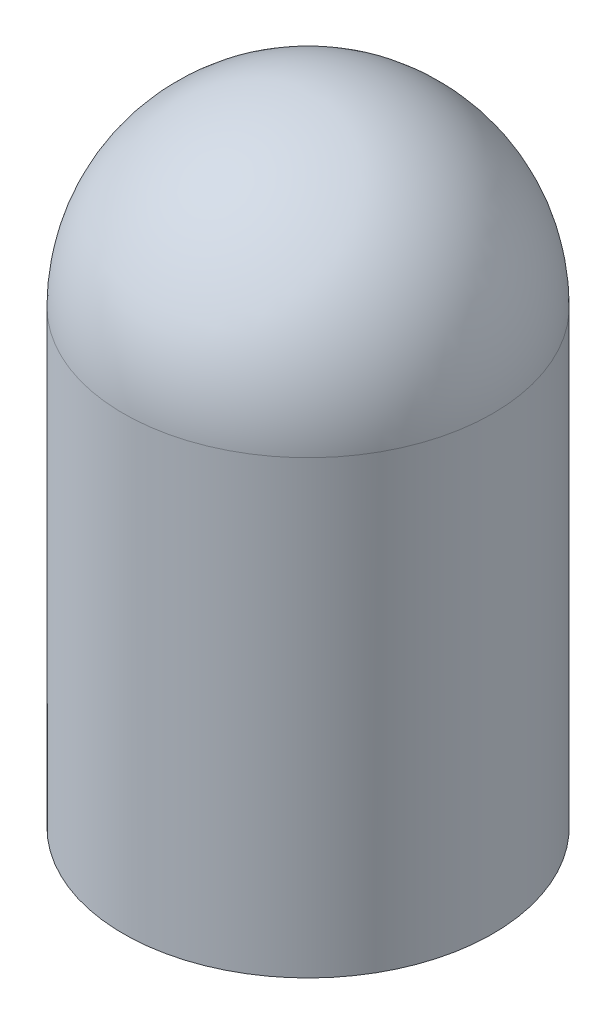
ISO-10303-21;
HEADER;
FILE_DESCRIPTION(('STEP AP214'),'2;1');
FILE_NAME('part.step','',(''),(''),'','','');
FILE_SCHEMA(('AUTOMOTIVE_DESIGN { 1 0 10303 214 1 1 1 1 }'));
ENDSEC;
DATA;
#1=APPLICATION_CONTEXT('core data for automotive mechanical design processes');
#2=APPLICATION_PROTOCOL_DEFINITION('international standard','automotive_design',2000,#1);
#3=PRODUCT_CONTEXT('',#1,'mechanical');
#4=PRODUCT('Part','Part','',(#3));
#5=PRODUCT_RELATED_PRODUCT_CATEGORY('part','',(#4));
#6=PRODUCT_DEFINITION_FORMATION('','',#4);
#7=PRODUCT_DEFINITION_CONTEXT('part definition',#1,'design');
#8=PRODUCT_DEFINITION('design','',#6,#7);
#9=PRODUCT_DEFINITION_SHAPE('','',#8);
#10=(LENGTH_UNIT() NAMED_UNIT(*) SI_UNIT(.MILLI.,.METRE.));
#11=(NAMED_UNIT(*) PLANE_ANGLE_UNIT() SI_UNIT($,.RADIAN.));
#12=(NAMED_UNIT(*) SI_UNIT($,.STERADIAN.) SOLID_ANGLE_UNIT());
#13=UNCERTAINTY_MEASURE_WITH_UNIT(LENGTH_MEASURE(1.E-05),#10,'distance_accuracy_value','');
#14=(GEOMETRIC_REPRESENTATION_CONTEXT(3) GLOBAL_UNCERTAINTY_ASSIGNED_CONTEXT((#13)) GLOBAL_UNIT_ASSIGNED_CONTEXT((#10,
#11,#12)) REPRESENTATION_CONTEXT('',''));
#15=CARTESIAN_POINT('',(0.,0.,0.));
#16=DIRECTION('',(0.,0.,1.));
#17=DIRECTION('',(1.,0.,0.));
#18=AXIS2_PLACEMENT_3D('',#15,#16,#17);
#19=CARTESIAN_POINT('',(0.,6.1,0.));
#20=DIRECTION('',(0.,-1.,0.));
#21=DIRECTION('',(1.,0.,0.));
#22=AXIS2_PLACEMENT_3D('',#19,#20,#21);
#23=SPHERICAL_SURFACE('',#22,2.5);
#24=CARTESIAN_POINT('',(0.,6.1,0.));
#25=DIRECTION('',(0.,-1.,0.));
#26=DIRECTION('',(0.,0.,-1.));
#27=AXIS2_PLACEMENT_3D('',#24,#25,#26);
#28=CIRCLE('',#27,2.5);
#29=CARTESIAN_POINT('',(0.,6.1,-2.5));
#30=VERTEX_POINT('',#29);
#31=EDGE_CURVE('E10',#30,#30,#28,.T.);
#32=ORIENTED_EDGE('',*,*,#31,.F.);
#33=EDGE_LOOP('',(#32));
#34=FACE_BOUND('',#33,.T.);
#35=ADVANCED_FACE('F28',(#34),#23,.T.);
#36=CARTESIAN_POINT('',(0.,-1.69587164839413,0.));
#37=DIRECTION('',(0.,-1.,0.));
#38=DIRECTION('',(0.,0.,-1.));
#39=AXIS2_PLACEMENT_3D('',#36,#37,#38);
#40=CYLINDRICAL_SURFACE('',#39,2.5);
#41=ORIENTED_EDGE('',*,*,#31,.T.);
#42=EDGE_LOOP('',(#41));
#43=FACE_BOUND('',#42,.T.);
#44=CARTESIAN_POINT('',(0.,0.,0.));
#45=DIRECTION('',(0.,-1.,0.));
#46=DIRECTION('',(0.,0.,-1.));
#47=AXIS2_PLACEMENT_3D('',#44,#45,#46);
#48=CIRCLE('',#47,2.5);
#49=CARTESIAN_POINT('',(0.,0.,-2.5));
#50=VERTEX_POINT('',#49);
#51=EDGE_CURVE('E34',#50,#50,#48,.T.);
#52=ORIENTED_EDGE('',*,*,#51,.F.);
#53=EDGE_LOOP('',(#52));
#54=FACE_BOUND('',#53,.T.);
#55=ADVANCED_FACE('F42',(#43,#54),#40,.T.);
#56=CARTESIAN_POINT('',(0.,0.,0.));
#57=DIRECTION('',(0.,-1.,0.));
#58=DIRECTION('',(0.,0.,-1.));
#59=AXIS2_PLACEMENT_3D('',#56,#57,#58);
#60=PLANE('',#59);
#61=ORIENTED_EDGE('',*,*,#51,.T.);
#62=EDGE_LOOP('',(#61));
#63=FACE_BOUND('',#62,.T.);
#64=ADVANCED_FACE('F40',(#63),#60,.T.);
#65=CLOSED_SHELL('',(#35,#55,#64));
#66=MANIFOLD_SOLID_BREP('B2',#65);
#67=ADVANCED_BREP_SHAPE_REPRESENTATION('',(#18,#66),#14);
#68=SHAPE_DEFINITION_REPRESENTATION(#9,#67);
ENDSEC;
END-ISO-10303-21;
